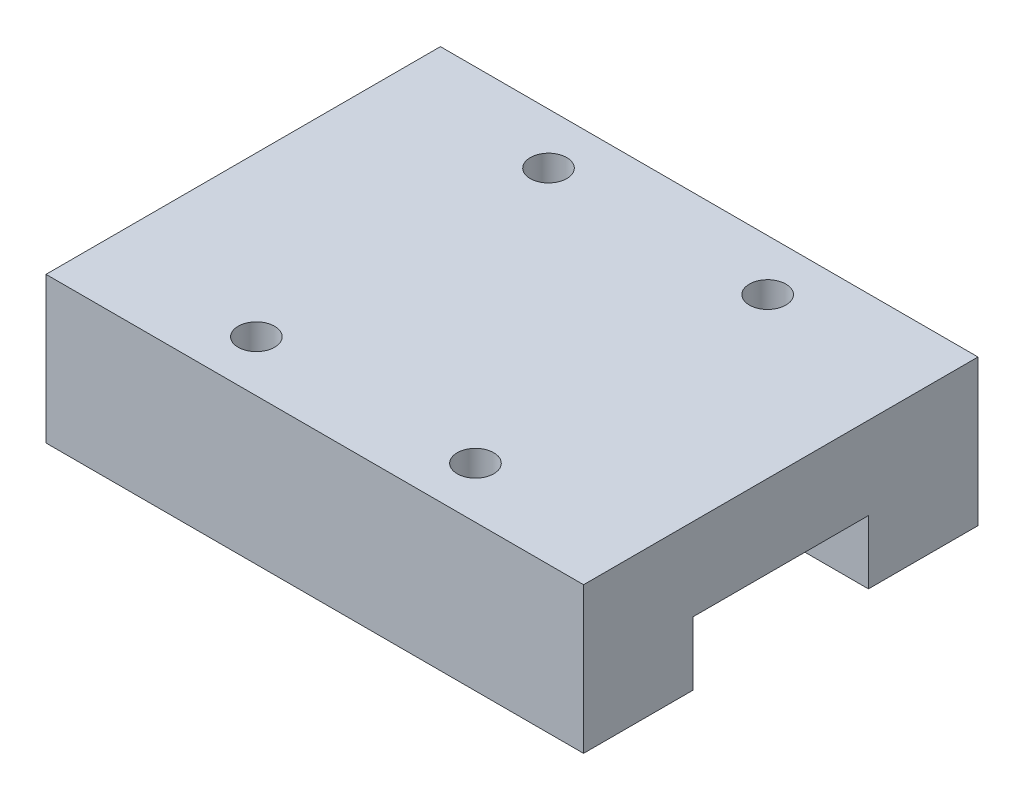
from build123d import *

# Parameters (mm, degrees)
SKETCH_1_W          = 36.8
SKETCH_1_H          = 10
EXTRUDE_1_DEPTH     = 27
SKETCH_2_R          = 1.25
CUT_EXTRUDE_1_DEPTH = 27
SKETCH_3_W          = 12
SKETCH_3_H          = 7.220511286
CUT_EXTRUDE_2_DEPTH = 47.725153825


with BuildPart() as part:
    # Sketch 1 → Extrude 1 (new body)
    with BuildSketch(Plane.XY):
        with Locations((18.4, 5)):
            Rectangle(SKETCH_1_W, SKETCH_1_H)
    extrude(amount=EXTRUDE_1_DEPTH)

    # Sketch 2 → Cut-Extrude 1 (cut)
    with BuildSketch(Plane(origin=(0, 10, 0), x_dir=(1, 0, 0), z_dir=(0, 1, 0))):
        with Locations(Location((10.9, -3.5, 0), (0, 0, 270))):
            Circle(SKETCH_2_R)
        with Locations(Location((10.9, -23.5, 0), (0, 0, 270))):
            Circle(SKETCH_2_R)
        with Locations(Location((25.9, -23.5, 0), (0, 0, 270))):
            Circle(SKETCH_2_R)
        with Locations(Location((25.9, -3.5, 0), (0, 0, 270))):
            Circle(SKETCH_2_R)
    extrude(amount=-CUT_EXTRUDE_1_DEPTH, mode=Mode.SUBTRACT)

    # Sketch 3 → Cut-Extrude 2 (cut, through all)
    with BuildSketch(Plane(origin=(36.8, 0, 0), x_dir=(0, 0, -1), z_dir=(1, 0, 0))):
        with Locations((-13.5, 0.739744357)):
            Rectangle(SKETCH_3_W, SKETCH_3_H)
    extrude(amount=-CUT_EXTRUDE_2_DEPTH, mode=Mode.SUBTRACT)


solid = part.part
